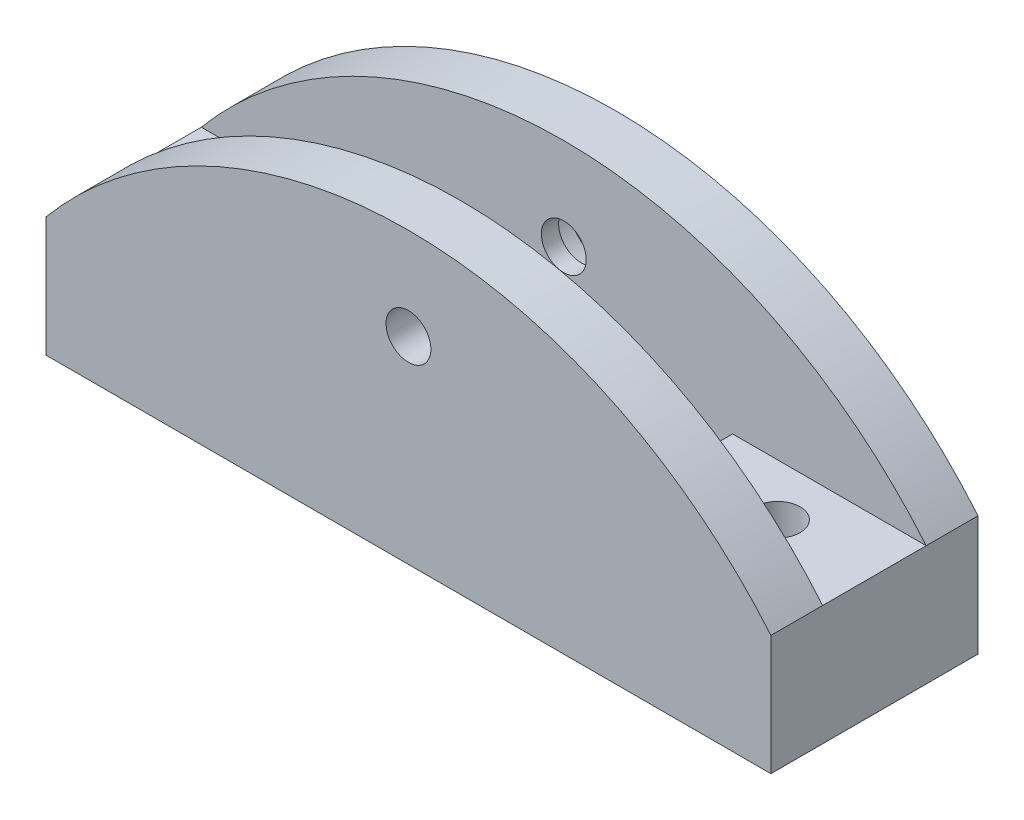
ISO-10303-21;
HEADER;
FILE_DESCRIPTION(('STEP AP214'),'2;1');
FILE_NAME('part.step','',(''),(''),'','','');
FILE_SCHEMA(('AUTOMOTIVE_DESIGN { 1 0 10303 214 1 1 1 1 }'));
ENDSEC;
DATA;
#1=APPLICATION_CONTEXT('core data for automotive mechanical design processes');
#2=APPLICATION_PROTOCOL_DEFINITION('international standard','automotive_design',2000,#1);
#3=PRODUCT_CONTEXT('',#1,'mechanical');
#4=PRODUCT('Part','Part','',(#3));
#5=PRODUCT_RELATED_PRODUCT_CATEGORY('part','',(#4));
#6=PRODUCT_DEFINITION_FORMATION('','',#4);
#7=PRODUCT_DEFINITION_CONTEXT('part definition',#1,'design');
#8=PRODUCT_DEFINITION('design','',#6,#7);
#9=PRODUCT_DEFINITION_SHAPE('','',#8);
#10=(LENGTH_UNIT() NAMED_UNIT(*) SI_UNIT(.MILLI.,.METRE.));
#11=(NAMED_UNIT(*) PLANE_ANGLE_UNIT() SI_UNIT($,.RADIAN.));
#12=(NAMED_UNIT(*) SI_UNIT($,.STERADIAN.) SOLID_ANGLE_UNIT());
#13=UNCERTAINTY_MEASURE_WITH_UNIT(LENGTH_MEASURE(1.E-05),#10,'distance_accuracy_value','');
#14=(GEOMETRIC_REPRESENTATION_CONTEXT(3) GLOBAL_UNCERTAINTY_ASSIGNED_CONTEXT((#13)) GLOBAL_UNIT_ASSIGNED_CONTEXT((#10,
#11,#12)) REPRESENTATION_CONTEXT('',''));
#15=CARTESIAN_POINT('',(0.,0.,0.));
#16=DIRECTION('',(0.,0.,1.));
#17=DIRECTION('',(1.,0.,0.));
#18=AXIS2_PLACEMENT_3D('',#15,#16,#17);
#19=CARTESIAN_POINT('',(0.,11.44,-6.));
#20=DIRECTION('',(0.,0.,1.));
#21=DIRECTION('',(1.,0.,0.));
#22=AXIS2_PLACEMENT_3D('',#19,#20,#21);
#23=CYLINDRICAL_SURFACE('',#22,1.3);
#24=CARTESIAN_POINT('',(0.,11.44,-3.));
#25=DIRECTION('',(0.,0.,-1.));
#26=DIRECTION('',(-1.,0.,0.));
#27=AXIS2_PLACEMENT_3D('',#24,#25,#26);
#28=CIRCLE('',#27,1.3);
#29=CARTESIAN_POINT('',(-1.3,11.44,-3.));
#30=VERTEX_POINT('',#29);
#31=EDGE_CURVE('E166',#30,#30,#28,.T.);
#32=ORIENTED_EDGE('',*,*,#31,.F.);
#33=EDGE_LOOP('',(#32));
#34=FACE_BOUND('',#33,.T.);
#35=CARTESIAN_POINT('',(0.,11.44,-4.));
#36=DIRECTION('',(0.,0.,-1.));
#37=DIRECTION('',(-1.,0.,0.));
#38=AXIS2_PLACEMENT_3D('',#35,#36,#37);
#39=CIRCLE('',#38,1.3);
#40=CARTESIAN_POINT('',(-1.3,11.44,-4.));
#41=VERTEX_POINT('',#40);
#42=EDGE_CURVE('E46',#41,#41,#39,.F.);
#43=ORIENTED_EDGE('',*,*,#42,.F.);
#44=EDGE_LOOP('',(#43));
#45=FACE_BOUND('',#44,.T.);
#46=ADVANCED_FACE('F42',(#34,#45),#23,.F.);
#47=CARTESIAN_POINT('',(0.,6.94,0.));
#48=DIRECTION('',(0.,-1.,0.));
#49=DIRECTION('',(0.,0.,-1.));
#50=AXIS2_PLACEMENT_3D('',#47,#48,#49);
#51=PLANE('',#50);
#52=CARTESIAN_POINT('',(15.3925,6.94,0.));
#53=DIRECTION('',(0.,1.,0.));
#54=DIRECTION('',(0.,0.,1.));
#55=AXIS2_PLACEMENT_3D('',#52,#53,#54);
#56=CIRCLE('',#55,1.3);
#57=CARTESIAN_POINT('',(15.3925,6.94,1.3));
#58=VERTEX_POINT('',#57);
#59=EDGE_CURVE('E191',#58,#58,#56,.T.);
#60=ORIENTED_EDGE('',*,*,#59,.F.);
#61=EDGE_LOOP('',(#60));
#62=FACE_BOUND('',#61,.T.);
#63=DIRECTION('',(1.,0.,0.));
#64=VECTOR('',#63,1.);
#65=CARTESIAN_POINT('',(0.,6.94,-3.));
#66=LINE('',#65,#64);
#67=CARTESIAN_POINT('',(9.78500000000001,6.94,-3.));
#68=VERTEX_POINT('',#67);
#69=CARTESIAN_POINT('',(21.,6.94,-3.));
#70=VERTEX_POINT('',#69);
#71=EDGE_CURVE('E67',#68,#70,#66,.T.);
#72=ORIENTED_EDGE('',*,*,#71,.F.);
#73=DIRECTION('',(0.,0.,1.));
#74=VECTOR('',#73,1.);
#75=CARTESIAN_POINT('',(9.78500000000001,6.94,-6.));
#76=LINE('',#75,#74);
#77=CARTESIAN_POINT('',(9.78500000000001,6.94,3.));
#78=VERTEX_POINT('',#77);
#79=EDGE_CURVE('E51',#68,#78,#76,.T.);
#80=ORIENTED_EDGE('',*,*,#79,.T.);
#81=DIRECTION('',(-1.,0.,0.));
#82=VECTOR('',#81,1.);
#83=CARTESIAN_POINT('',(0.,6.94,3.));
#84=LINE('',#83,#82);
#85=CARTESIAN_POINT('',(21.,6.94,3.));
#86=VERTEX_POINT('',#85);
#87=EDGE_CURVE('E151',#86,#78,#84,.T.);
#88=ORIENTED_EDGE('',*,*,#87,.F.);
#89=DIRECTION('',(0.,0.,-1.));
#90=VECTOR('',#89,1.);
#91=CARTESIAN_POINT('',(21.,6.94,6.));
#92=LINE('',#91,#90);
#93=EDGE_CURVE('E156',#86,#70,#92,.T.);
#94=ORIENTED_EDGE('',*,*,#93,.T.);
#95=EDGE_LOOP('',(#72,#80,#88,#94));
#96=FACE_BOUND('',#95,.T.);
#97=ADVANCED_FACE('F214',(#62,#96),#51,.F.);
#98=CARTESIAN_POINT('',(-15.3925,6.94,0.));
#99=DIRECTION('',(0.,1.,0.));
#100=DIRECTION('',(0.,0.,1.));
#101=AXIS2_PLACEMENT_3D('',#98,#99,#100);
#102=CIRCLE('',#101,1.3);
#103=CARTESIAN_POINT('',(-15.3925,6.94,1.3));
#104=VERTEX_POINT('',#103);
#105=EDGE_CURVE('E188',#104,#104,#102,.T.);
#106=ORIENTED_EDGE('',*,*,#105,.F.);
#107=EDGE_LOOP('',(#106));
#108=FACE_BOUND('',#107,.T.);
#109=DIRECTION('',(1.,0.,0.));
#110=VECTOR('',#109,1.);
#111=CARTESIAN_POINT('',(0.,6.94,-3.));
#112=LINE('',#111,#110);
#113=CARTESIAN_POINT('',(-21.,6.94,-3.));
#114=VERTEX_POINT('',#113);
#115=CARTESIAN_POINT('',(-9.785,6.94,-3.));
#116=VERTEX_POINT('',#115);
#117=EDGE_CURVE('E125',#114,#116,#112,.T.);
#118=ORIENTED_EDGE('',*,*,#117,.F.);
#119=DIRECTION('',(0.,0.,1.));
#120=VECTOR('',#119,1.);
#121=CARTESIAN_POINT('',(-21.,6.94,6.));
#122=LINE('',#121,#120);
#123=CARTESIAN_POINT('',(-21.,6.94,3.));
#124=VERTEX_POINT('',#123);
#125=EDGE_CURVE('E111',#114,#124,#122,.T.);
#126=ORIENTED_EDGE('',*,*,#125,.T.);
#127=DIRECTION('',(-1.,0.,0.));
#128=VECTOR('',#127,1.);
#129=CARTESIAN_POINT('',(0.,6.94,3.));
#130=LINE('',#129,#128);
#131=CARTESIAN_POINT('',(-9.785,6.94,3.));
#132=VERTEX_POINT('',#131);
#133=EDGE_CURVE('E207',#132,#124,#130,.T.);
#134=ORIENTED_EDGE('',*,*,#133,.F.);
#135=DIRECTION('',(0.,0.,1.));
#136=VECTOR('',#135,1.);
#137=CARTESIAN_POINT('',(-9.785,6.94,-6.));
#138=LINE('',#137,#136);
#139=EDGE_CURVE('E128',#132,#116,#138,.F.);
#140=ORIENTED_EDGE('',*,*,#139,.T.);
#141=EDGE_LOOP('',(#118,#126,#134,#140));
#142=FACE_BOUND('',#141,.T.);
#143=ADVANCED_FACE('F127',(#108,#142),#51,.F.);
#144=CARTESIAN_POINT('',(0.,11.4402651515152,-6.));
#145=DIRECTION('',(0.,0.,1.));
#146=DIRECTION('',(1.,0.,0.));
#147=AXIS2_PLACEMENT_3D('',#144,#145,#146);
#148=CYLINDRICAL_SURFACE('',#147,10.7702651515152);
#149=CARTESIAN_POINT('',(0.,11.4402651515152,-3.));
#150=DIRECTION('',(0.,0.,-1.));
#151=DIRECTION('',(-1.,0.,0.));
#152=AXIS2_PLACEMENT_3D('',#149,#150,#151);
#153=CIRCLE('',#152,10.7702651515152);
#154=EDGE_CURVE('E59',#116,#68,#153,.F.);
#155=ORIENTED_EDGE('',*,*,#154,.F.);
#156=ORIENTED_EDGE('',*,*,#139,.F.);
#157=CARTESIAN_POINT('',(0.,11.4402651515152,3.));
#158=DIRECTION('',(0.,0.,1.));
#159=DIRECTION('',(1.,0.,0.));
#160=AXIS2_PLACEMENT_3D('',#157,#158,#159);
#161=CIRCLE('',#160,10.7702651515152);
#162=EDGE_CURVE('E11',#78,#132,#161,.F.);
#163=ORIENTED_EDGE('',*,*,#162,.F.);
#164=ORIENTED_EDGE('',*,*,#79,.F.);
#165=EDGE_LOOP('',(#155,#156,#163,#164));
#166=FACE_BOUND('',#165,.T.);
#167=ADVANCED_FACE('F238',(#166),#148,.F.);
#168=CARTESIAN_POINT('',(21.,6.94,6.));
#169=DIRECTION('',(-1.,0.,0.));
#170=DIRECTION('',(0.,0.,1.));
#171=AXIS2_PLACEMENT_3D('',#168,#169,#170);
#172=PLANE('',#171);
#173=DIRECTION('',(0.,0.,-1.));
#174=VECTOR('',#173,1.);
#175=CARTESIAN_POINT('',(21.,6.94,-3.));
#176=LINE('',#175,#174);
#177=CARTESIAN_POINT('',(21.,6.94,-6.));
#178=VERTEX_POINT('',#177);
#179=EDGE_CURVE('E136',#70,#178,#176,.T.);
#180=ORIENTED_EDGE('',*,*,#179,.F.);
#181=ORIENTED_EDGE('',*,*,#93,.F.);
#182=CARTESIAN_POINT('',(21.,6.94,6.));
#183=VERTEX_POINT('',#182);
#184=EDGE_CURVE('E122',#183,#86,#92,.T.);
#185=ORIENTED_EDGE('',*,*,#184,.F.);
#186=DIRECTION('',(0.,-1.,0.));
#187=VECTOR('',#186,1.);
#188=CARTESIAN_POINT('',(21.,6.94,6.));
#189=LINE('',#188,#187);
#190=CARTESIAN_POINT('',(21.,0.,6.));
#191=VERTEX_POINT('',#190);
#192=EDGE_CURVE('E141',#183,#191,#189,.T.);
#193=ORIENTED_EDGE('',*,*,#192,.T.);
#194=DIRECTION('',(0.,0.,-1.));
#195=VECTOR('',#194,1.);
#196=CARTESIAN_POINT('',(21.,0.,6.));
#197=LINE('',#196,#195);
#198=CARTESIAN_POINT('',(21.,0.,-6.));
#199=VERTEX_POINT('',#198);
#200=EDGE_CURVE('E148',#191,#199,#197,.T.);
#201=ORIENTED_EDGE('',*,*,#200,.T.);
#202=DIRECTION('',(0.,-1.,0.));
#203=VECTOR('',#202,1.);
#204=CARTESIAN_POINT('',(21.,6.94,-6.));
#205=LINE('',#204,#203);
#206=EDGE_CURVE('E162',#178,#199,#205,.T.);
#207=ORIENTED_EDGE('',*,*,#206,.F.);
#208=EDGE_LOOP('',(#180,#181,#185,#193,#201,#207));
#209=FACE_BOUND('',#208,.T.);
#210=ADVANCED_FACE('F44',(#209),#172,.F.);
#211=CARTESIAN_POINT('',(-21.,6.94,-6.));
#212=DIRECTION('',(0.,0.,1.));
#213=DIRECTION('',(1.,0.,0.));
#214=AXIS2_PLACEMENT_3D('',#211,#212,#213);
#215=PLANE('',#214);
#216=CARTESIAN_POINT('',(0.,11.44,-6.));
#217=DIRECTION('',(0.,0.,-1.));
#218=DIRECTION('',(-1.,0.,0.));
#219=AXIS2_PLACEMENT_3D('',#216,#217,#218);
#220=CIRCLE('',#219,3.);
#221=CARTESIAN_POINT('',(-3.,11.44,-6.));
#222=VERTEX_POINT('',#221);
#223=EDGE_CURVE('E182',#222,#222,#220,.T.);
#224=ORIENTED_EDGE('',*,*,#223,.F.);
#225=EDGE_LOOP('',(#224));
#226=FACE_BOUND('',#225,.T.);
#227=DIRECTION('',(0.,-1.,0.));
#228=VECTOR('',#227,1.);
#229=CARTESIAN_POINT('',(-21.,6.94,-6.));
#230=LINE('',#229,#228);
#231=CARTESIAN_POINT('',(-21.,6.94,-6.));
#232=VERTEX_POINT('',#231);
#233=CARTESIAN_POINT('',(-21.,0.,-6.));
#234=VERTEX_POINT('',#233);
#235=EDGE_CURVE('E160',#232,#234,#230,.T.);
#236=ORIENTED_EDGE('',*,*,#235,.F.);
#237=CARTESIAN_POINT('',(0.,-10.5763326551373,-6.));
#238=DIRECTION('',(0.,0.,1.));
#239=DIRECTION('',(1.,0.,0.));
#240=AXIS2_PLACEMENT_3D('',#237,#238,#239);
#241=CIRCLE('',#240,27.3463326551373);
#242=EDGE_CURVE('E137',#178,#232,#241,.T.);
#243=ORIENTED_EDGE('',*,*,#242,.F.);
#244=ORIENTED_EDGE('',*,*,#206,.T.);
#245=DIRECTION('',(-1.,0.,0.));
#246=VECTOR('',#245,1.);
#247=CARTESIAN_POINT('',(-21.,0.,-6.));
#248=LINE('',#247,#246);
#249=EDGE_CURVE('E150',#199,#234,#248,.T.);
#250=ORIENTED_EDGE('',*,*,#249,.T.);
#251=EDGE_LOOP('',(#236,#243,#244,#250));
#252=FACE_BOUND('',#251,.T.);
#253=ADVANCED_FACE('F230',(#226,#252),#215,.F.);
#254=CARTESIAN_POINT('',(-21.,6.94,6.));
#255=DIRECTION('',(1.,0.,0.));
#256=DIRECTION('',(0.,0.,-1.));
#257=AXIS2_PLACEMENT_3D('',#254,#255,#256);
#258=PLANE('',#257);
#259=DIRECTION('',(0.,0.,1.));
#260=VECTOR('',#259,1.);
#261=CARTESIAN_POINT('',(-21.,0.,6.));
#262=LINE('',#261,#260);
#263=CARTESIAN_POINT('',(-21.,0.,6.));
#264=VERTEX_POINT('',#263);
#265=EDGE_CURVE('E153',#234,#264,#262,.T.);
#266=ORIENTED_EDGE('',*,*,#265,.T.);
#267=DIRECTION('',(0.,-1.,0.));
#268=VECTOR('',#267,1.);
#269=CARTESIAN_POINT('',(-21.,6.94,6.));
#270=LINE('',#269,#268);
#271=CARTESIAN_POINT('',(-21.,6.94,6.));
#272=VERTEX_POINT('',#271);
#273=EDGE_CURVE('E143',#272,#264,#270,.T.);
#274=ORIENTED_EDGE('',*,*,#273,.F.);
#275=DIRECTION('',(0.,0.,1.));
#276=VECTOR('',#275,1.);
#277=CARTESIAN_POINT('',(-21.,6.94,3.));
#278=LINE('',#277,#276);
#279=EDGE_CURVE('E119',#124,#272,#278,.T.);
#280=ORIENTED_EDGE('',*,*,#279,.F.);
#281=ORIENTED_EDGE('',*,*,#125,.F.);
#282=EDGE_CURVE('E116',#232,#114,#122,.T.);
#283=ORIENTED_EDGE('',*,*,#282,.F.);
#284=ORIENTED_EDGE('',*,*,#235,.T.);
#285=EDGE_LOOP('',(#266,#274,#280,#281,#283,#284));
#286=FACE_BOUND('',#285,.T.);
#287=ADVANCED_FACE('F113',(#286),#258,.F.);
#288=CARTESIAN_POINT('',(-21.,6.94,6.));
#289=DIRECTION('',(0.,0.,-1.));
#290=DIRECTION('',(-1.,0.,0.));
#291=AXIS2_PLACEMENT_3D('',#288,#289,#290);
#292=PLANE('',#291);
#293=CARTESIAN_POINT('',(0.,11.44,6.));
#294=DIRECTION('',(0.,0.,1.));
#295=DIRECTION('',(1.,0.,0.));
#296=AXIS2_PLACEMENT_3D('',#293,#294,#295);
#297=CIRCLE('',#296,1.3);
#298=CARTESIAN_POINT('',(1.3,11.44,6.));
#299=VERTEX_POINT('',#298);
#300=EDGE_CURVE('E169',#299,#299,#297,.T.);
#301=ORIENTED_EDGE('',*,*,#300,.F.);
#302=EDGE_LOOP('',(#301));
#303=FACE_BOUND('',#302,.T.);
#304=ORIENTED_EDGE('',*,*,#192,.F.);
#305=CARTESIAN_POINT('',(0.,-10.5763326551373,6.));
#306=DIRECTION('',(0.,0.,1.));
#307=DIRECTION('',(1.,0.,0.));
#308=AXIS2_PLACEMENT_3D('',#305,#306,#307);
#309=CIRCLE('',#308,27.3463326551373);
#310=EDGE_CURVE('E200',#183,#272,#309,.T.);
#311=ORIENTED_EDGE('',*,*,#310,.T.);
#312=ORIENTED_EDGE('',*,*,#273,.T.);
#313=DIRECTION('',(1.,0.,0.));
#314=VECTOR('',#313,1.);
#315=CARTESIAN_POINT('',(-21.,0.,6.));
#316=LINE('',#315,#314);
#317=EDGE_CURVE('E155',#264,#191,#316,.T.);
#318=ORIENTED_EDGE('',*,*,#317,.T.);
#319=EDGE_LOOP('',(#304,#311,#312,#318));
#320=FACE_BOUND('',#319,.T.);
#321=ADVANCED_FACE('F222',(#303,#320),#292,.F.);
#322=CARTESIAN_POINT('',(0.,0.,0.));
#323=DIRECTION('',(0.,-1.,0.));
#324=DIRECTION('',(0.,0.,-1.));
#325=AXIS2_PLACEMENT_3D('',#322,#323,#324);
#326=PLANE('',#325);
#327=CARTESIAN_POINT('',(-15.3925,0.,0.));
#328=DIRECTION('',(0.,1.,0.));
#329=DIRECTION('',(0.,0.,1.));
#330=AXIS2_PLACEMENT_3D('',#327,#328,#329);
#331=CIRCLE('',#330,1.3);
#332=CARTESIAN_POINT('',(-15.3925,0.,1.3));
#333=VERTEX_POINT('',#332);
#334=EDGE_CURVE('E185',#333,#333,#331,.T.);
#335=ORIENTED_EDGE('',*,*,#334,.T.);
#336=EDGE_LOOP('',(#335));
#337=FACE_BOUND('',#336,.T.);
#338=CARTESIAN_POINT('',(15.3925,0.,0.));
#339=DIRECTION('',(0.,1.,0.));
#340=DIRECTION('',(0.,0.,1.));
#341=AXIS2_PLACEMENT_3D('',#338,#339,#340);
#342=CIRCLE('',#341,1.3);
#343=CARTESIAN_POINT('',(15.3925,0.,1.3));
#344=VERTEX_POINT('',#343);
#345=EDGE_CURVE('E173',#344,#344,#342,.T.);
#346=ORIENTED_EDGE('',*,*,#345,.T.);
#347=EDGE_LOOP('',(#346));
#348=FACE_BOUND('',#347,.T.);
#349=ORIENTED_EDGE('',*,*,#249,.F.);
#350=ORIENTED_EDGE('',*,*,#200,.F.);
#351=ORIENTED_EDGE('',*,*,#317,.F.);
#352=ORIENTED_EDGE('',*,*,#265,.F.);
#353=EDGE_LOOP('',(#349,#350,#351,#352));
#354=FACE_BOUND('',#353,.T.);
#355=ADVANCED_FACE('F227',(#337,#348,#354),#326,.T.);
#356=CARTESIAN_POINT('',(0.,-10.5763326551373,3.));
#357=DIRECTION('',(0.,0.,1.));
#358=DIRECTION('',(1.,0.,0.));
#359=AXIS2_PLACEMENT_3D('',#356,#357,#358);
#360=PLANE('',#359);
#361=CARTESIAN_POINT('',(0.,11.44,3.));
#362=DIRECTION('',(0.,0.,1.));
#363=DIRECTION('',(1.,0.,0.));
#364=AXIS2_PLACEMENT_3D('',#361,#362,#363);
#365=CIRCLE('',#364,1.3);
#366=CARTESIAN_POINT('',(1.3,11.44,3.));
#367=VERTEX_POINT('',#366);
#368=EDGE_CURVE('E168',#367,#367,#365,.T.);
#369=ORIENTED_EDGE('',*,*,#368,.T.);
#370=EDGE_LOOP('',(#369));
#371=FACE_BOUND('',#370,.T.);
#372=CARTESIAN_POINT('',(0.,-10.5763326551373,3.));
#373=DIRECTION('',(0.,0.,1.));
#374=DIRECTION('',(1.,0.,0.));
#375=AXIS2_PLACEMENT_3D('',#372,#373,#374);
#376=CIRCLE('',#375,27.3463326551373);
#377=EDGE_CURVE('E201',#86,#124,#376,.T.);
#378=ORIENTED_EDGE('',*,*,#377,.F.);
#379=ORIENTED_EDGE('',*,*,#87,.T.);
#380=ORIENTED_EDGE('',*,*,#162,.T.);
#381=ORIENTED_EDGE('',*,*,#133,.T.);
#382=EDGE_LOOP('',(#378,#379,#380,#381));
#383=FACE_BOUND('',#382,.T.);
#384=ADVANCED_FACE('F211',(#371,#383),#360,.F.);
#385=CARTESIAN_POINT('',(0.,-10.5763326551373,3.));
#386=DIRECTION('',(0.,0.,1.));
#387=DIRECTION('',(1.,0.,0.));
#388=AXIS2_PLACEMENT_3D('',#385,#386,#387);
#389=CYLINDRICAL_SURFACE('',#388,27.3463326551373);
#390=ORIENTED_EDGE('',*,*,#310,.F.);
#391=ORIENTED_EDGE('',*,*,#184,.T.);
#392=ORIENTED_EDGE('',*,*,#377,.T.);
#393=ORIENTED_EDGE('',*,*,#279,.T.);
#394=EDGE_LOOP('',(#390,#391,#392,#393));
#395=FACE_BOUND('',#394,.T.);
#396=ADVANCED_FACE('F220',(#395),#389,.T.);
#397=CARTESIAN_POINT('',(0.,-10.5763326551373,-3.));
#398=DIRECTION('',(0.,0.,-1.));
#399=DIRECTION('',(1.,0.,0.));
#400=AXIS2_PLACEMENT_3D('',#397,#398,#399);
#401=PLANE('',#400);
#402=ORIENTED_EDGE('',*,*,#31,.T.);
#403=EDGE_LOOP('',(#402));
#404=FACE_BOUND('',#403,.T.);
#405=ORIENTED_EDGE('',*,*,#154,.T.);
#406=ORIENTED_EDGE('',*,*,#71,.T.);
#407=CARTESIAN_POINT('',(0.,-10.5763326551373,-3.));
#408=DIRECTION('',(0.,0.,1.));
#409=DIRECTION('',(1.,0.,0.));
#410=AXIS2_PLACEMENT_3D('',#407,#408,#409);
#411=CIRCLE('',#410,27.3463326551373);
#412=EDGE_CURVE('E132',#70,#114,#411,.T.);
#413=ORIENTED_EDGE('',*,*,#412,.T.);
#414=ORIENTED_EDGE('',*,*,#117,.T.);
#415=EDGE_LOOP('',(#405,#406,#413,#414));
#416=FACE_BOUND('',#415,.T.);
#417=ADVANCED_FACE('F133',(#404,#416),#401,.F.);
#418=CARTESIAN_POINT('',(0.,-10.5763326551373,-3.));
#419=DIRECTION('',(0.,0.,-1.));
#420=DIRECTION('',(-1.,0.,0.));
#421=AXIS2_PLACEMENT_3D('',#418,#419,#420);
#422=CYLINDRICAL_SURFACE('',#421,27.3463326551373);
#423=ORIENTED_EDGE('',*,*,#242,.T.);
#424=ORIENTED_EDGE('',*,*,#282,.T.);
#425=ORIENTED_EDGE('',*,*,#412,.F.);
#426=ORIENTED_EDGE('',*,*,#179,.T.);
#427=EDGE_LOOP('',(#423,#424,#425,#426));
#428=FACE_BOUND('',#427,.T.);
#429=ADVANCED_FACE('F139',(#428),#422,.T.);
#430=CARTESIAN_POINT('',(15.3925,0.,0.));
#431=DIRECTION('',(0.,1.,0.));
#432=DIRECTION('',(0.,0.,1.));
#433=AXIS2_PLACEMENT_3D('',#430,#431,#432);
#434=CYLINDRICAL_SURFACE('',#433,1.3);
#435=ORIENTED_EDGE('',*,*,#345,.F.);
#436=EDGE_LOOP('',(#435));
#437=FACE_BOUND('',#436,.T.);
#438=ORIENTED_EDGE('',*,*,#59,.T.);
#439=EDGE_LOOP('',(#438));
#440=FACE_BOUND('',#439,.T.);
#441=ADVANCED_FACE('F262',(#437,#440),#434,.F.);
#442=CARTESIAN_POINT('',(-15.3925,0.,0.));
#443=DIRECTION('',(0.,1.,0.));
#444=DIRECTION('',(0.,0.,1.));
#445=AXIS2_PLACEMENT_3D('',#442,#443,#444);
#446=CYLINDRICAL_SURFACE('',#445,1.3);
#447=ORIENTED_EDGE('',*,*,#334,.F.);
#448=EDGE_LOOP('',(#447));
#449=FACE_BOUND('',#448,.T.);
#450=ORIENTED_EDGE('',*,*,#105,.T.);
#451=EDGE_LOOP('',(#450));
#452=FACE_BOUND('',#451,.T.);
#453=ADVANCED_FACE('F254',(#449,#452),#446,.F.);
#454=ORIENTED_EDGE('',*,*,#300,.T.);
#455=EDGE_LOOP('',(#454));
#456=FACE_BOUND('',#455,.T.);
#457=ORIENTED_EDGE('',*,*,#368,.F.);
#458=EDGE_LOOP('',(#457));
#459=FACE_BOUND('',#458,.T.);
#460=ADVANCED_FACE('F243',(#456,#459),#23,.F.);
#461=CARTESIAN_POINT('',(0.,11.44,-4.));
#462=DIRECTION('',(0.,0.,-1.));
#463=DIRECTION('',(-1.,0.,0.));
#464=AXIS2_PLACEMENT_3D('',#461,#462,#463);
#465=PLANE('',#464);
#466=CARTESIAN_POINT('',(0.,11.44,-4.));
#467=DIRECTION('',(0.,0.,-1.));
#468=DIRECTION('',(-1.,0.,0.));
#469=AXIS2_PLACEMENT_3D('',#466,#467,#468);
#470=CIRCLE('',#469,3.);
#471=CARTESIAN_POINT('',(-3.,11.44,-4.));
#472=VERTEX_POINT('',#471);
#473=EDGE_CURVE('E180',#472,#472,#470,.T.);
#474=ORIENTED_EDGE('',*,*,#473,.T.);
#475=EDGE_LOOP('',(#474));
#476=FACE_BOUND('',#475,.T.);
#477=ORIENTED_EDGE('',*,*,#42,.T.);
#478=EDGE_LOOP('',(#477));
#479=FACE_BOUND('',#478,.T.);
#480=ADVANCED_FACE('F253',(#476,#479),#465,.T.);
#481=CARTESIAN_POINT('',(0.,11.44,-4.));
#482=DIRECTION('',(0.,0.,-1.));
#483=DIRECTION('',(-1.,0.,0.));
#484=AXIS2_PLACEMENT_3D('',#481,#482,#483);
#485=CYLINDRICAL_SURFACE('',#484,3.);
#486=ORIENTED_EDGE('',*,*,#473,.F.);
#487=EDGE_LOOP('',(#486));
#488=FACE_BOUND('',#487,.T.);
#489=ORIENTED_EDGE('',*,*,#223,.T.);
#490=EDGE_LOOP('',(#489));
#491=FACE_BOUND('',#490,.T.);
#492=ADVANCED_FACE('F259',(#488,#491),#485,.F.);
#493=CLOSED_SHELL('',(#46,#97,#143,#167,#210,#253,#287,#321,#355,#384,#396,#417,#429,#441,#453,
#460,#480,#492));
#494=MANIFOLD_SOLID_BREP('B2',#493);
#495=ADVANCED_BREP_SHAPE_REPRESENTATION('',(#18,#494),#14);
#496=SHAPE_DEFINITION_REPRESENTATION(#9,#495);
ENDSEC;
END-ISO-10303-21;
